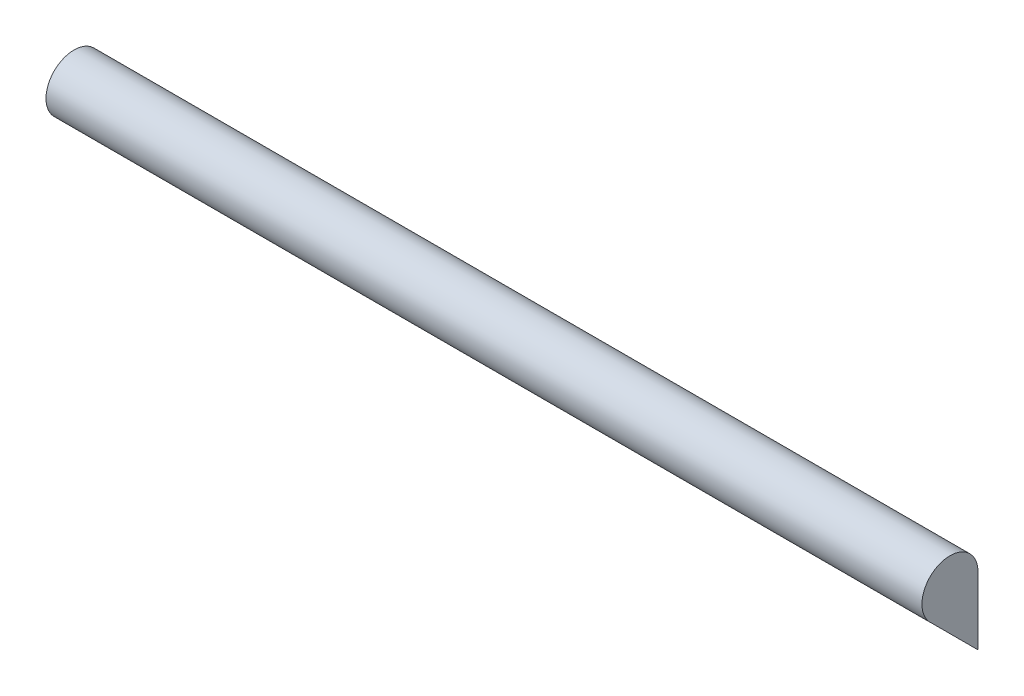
ISO-10303-21;
HEADER;
FILE_DESCRIPTION(('STEP AP214'),'2;1');
FILE_NAME('part.step','',(''),(''),'','','');
FILE_SCHEMA(('AUTOMOTIVE_DESIGN { 1 0 10303 214 1 1 1 1 }'));
ENDSEC;
DATA;
#1=APPLICATION_CONTEXT('core data for automotive mechanical design processes');
#2=APPLICATION_PROTOCOL_DEFINITION('international standard','automotive_design',2000,#1);
#3=PRODUCT_CONTEXT('',#1,'mechanical');
#4=PRODUCT('Part','Part','',(#3));
#5=PRODUCT_RELATED_PRODUCT_CATEGORY('part','',(#4));
#6=PRODUCT_DEFINITION_FORMATION('','',#4);
#7=PRODUCT_DEFINITION_CONTEXT('part definition',#1,'design');
#8=PRODUCT_DEFINITION('design','',#6,#7);
#9=PRODUCT_DEFINITION_SHAPE('','',#8);
#10=(LENGTH_UNIT() NAMED_UNIT(*) SI_UNIT(.MILLI.,.METRE.));
#11=(NAMED_UNIT(*) PLANE_ANGLE_UNIT() SI_UNIT($,.RADIAN.));
#12=(NAMED_UNIT(*) SI_UNIT($,.STERADIAN.) SOLID_ANGLE_UNIT());
#13=UNCERTAINTY_MEASURE_WITH_UNIT(LENGTH_MEASURE(1.E-05),#10,'distance_accuracy_value','');
#14=(GEOMETRIC_REPRESENTATION_CONTEXT(3) GLOBAL_UNCERTAINTY_ASSIGNED_CONTEXT((#13)) GLOBAL_UNIT_ASSIGNED_CONTEXT((#10,
#11,#12)) REPRESENTATION_CONTEXT('',''));
#15=CARTESIAN_POINT('',(0.,0.,0.));
#16=DIRECTION('',(0.,0.,1.));
#17=DIRECTION('',(1.,0.,0.));
#18=AXIS2_PLACEMENT_3D('',#15,#16,#17);
#19=CARTESIAN_POINT('',(0.,0.,0.));
#20=DIRECTION('',(0.,-0.707106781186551,0.707106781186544));
#21=DIRECTION('',(-1.,0.,0.));
#22=AXIS2_PLACEMENT_3D('',#19,#20,#21);
#23=PLANE('',#22);
#24=DIRECTION('',(-1.,0.,0.));
#25=VECTOR('',#24,1.);
#26=CARTESIAN_POINT('',(0.,3.59210244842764,3.59210244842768));
#27=LINE('',#26,#25);
#28=CARTESIAN_POINT('',(68.1829479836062,3.59210244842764,3.59210244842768));
#29=VERTEX_POINT('',#28);
#30=CARTESIAN_POINT('',(0.,3.59210244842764,3.59210244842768));
#31=VERTEX_POINT('',#30);
#32=EDGE_CURVE('E59',#29,#31,#27,.T.);
#33=ORIENTED_EDGE('',*,*,#32,.T.);
#34=DIRECTION('',(0.,0.707106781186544,0.707106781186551));
#35=VECTOR('',#34,1.);
#36=CARTESIAN_POINT('',(0.,0.,0.));
#37=LINE('',#36,#35);
#38=CARTESIAN_POINT('',(0.,0.,0.));
#39=VERTEX_POINT('',#38);
#40=EDGE_CURVE('E93',#39,#31,#37,.T.);
#41=ORIENTED_EDGE('',*,*,#40,.F.);
#42=DIRECTION('',(1.,0.,0.));
#43=VECTOR('',#42,1.);
#44=CARTESIAN_POINT('',(0.,0.,0.));
#45=LINE('',#44,#43);
#46=CARTESIAN_POINT('',(68.1829479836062,0.,0.));
#47=VERTEX_POINT('',#46);
#48=EDGE_CURVE('E88',#39,#47,#45,.T.);
#49=ORIENTED_EDGE('',*,*,#48,.T.);
#50=DIRECTION('',(0.,0.707106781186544,0.707106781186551));
#51=VECTOR('',#50,1.);
#52=CARTESIAN_POINT('',(68.1829479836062,0.,0.));
#53=LINE('',#52,#51);
#54=EDGE_CURVE('E99',#47,#29,#53,.T.);
#55=ORIENTED_EDGE('',*,*,#54,.T.);
#56=EDGE_LOOP('',(#33,#41,#49,#55));
#57=FACE_BOUND('',#56,.T.);
#58=ADVANCED_FACE('F55',(#57),#23,.T.);
#59=CARTESIAN_POINT('',(68.1829479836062,5.25285474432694,2.17580367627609));
#60=DIRECTION('',(-1.,0.,0.));
#61=DIRECTION('',(0.,0.,1.));
#62=AXIS2_PLACEMENT_3D('',#59,#60,#61);
#63=PLANE('',#62);
#64=DIRECTION('',(0.,-1.,0.));
#65=VECTOR('',#64,1.);
#66=CARTESIAN_POINT('',(68.1829479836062,5.08,0.));
#67=LINE('',#66,#65);
#68=CARTESIAN_POINT('',(68.1829479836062,5.08,0.));
#69=VERTEX_POINT('',#68);
#70=EDGE_CURVE('E109',#69,#47,#67,.T.);
#71=ORIENTED_EDGE('',*,*,#70,.F.);
#72=CARTESIAN_POINT('',(68.1829479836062,5.25285474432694,2.17580367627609));
#73=DIRECTION('',(1.,0.,0.));
#74=DIRECTION('',(0.,0.,-1.));
#75=AXIS2_PLACEMENT_3D('',#72,#73,#74);
#76=CIRCLE('',#75,2.18265902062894);
#77=EDGE_CURVE('E101',#69,#29,#76,.T.);
#78=ORIENTED_EDGE('',*,*,#77,.T.);
#79=ORIENTED_EDGE('',*,*,#54,.F.);
#80=EDGE_LOOP('',(#71,#78,#79));
#81=FACE_BOUND('',#80,.T.);
#82=ADVANCED_FACE('F121',(#81),#63,.F.);
#83=CARTESIAN_POINT('',(0.,5.08,0.));
#84=DIRECTION('',(0.,0.,-1.));
#85=DIRECTION('',(-1.,0.,0.));
#86=AXIS2_PLACEMENT_3D('',#83,#84,#85);
#87=PLANE('',#86);
#88=ORIENTED_EDGE('',*,*,#48,.F.);
#89=DIRECTION('',(0.,-1.,0.));
#90=VECTOR('',#89,1.);
#91=CARTESIAN_POINT('',(0.,5.08,0.));
#92=LINE('',#91,#90);
#93=CARTESIAN_POINT('',(0.,5.08000000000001,0.));
#94=VERTEX_POINT('',#93);
#95=EDGE_CURVE('E95',#94,#39,#92,.T.);
#96=ORIENTED_EDGE('',*,*,#95,.F.);
#97=DIRECTION('',(-1.,0.,0.));
#98=VECTOR('',#97,1.);
#99=CARTESIAN_POINT('',(0.,5.08,0.));
#100=LINE('',#99,#98);
#101=EDGE_CURVE('E65',#94,#69,#100,.F.);
#102=ORIENTED_EDGE('',*,*,#101,.T.);
#103=ORIENTED_EDGE('',*,*,#70,.T.);
#104=EDGE_LOOP('',(#88,#96,#102,#103));
#105=FACE_BOUND('',#104,.T.);
#106=ADVANCED_FACE('F120',(#105),#87,.T.);
#107=CARTESIAN_POINT('',(0.,5.25285474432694,2.17580367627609));
#108=DIRECTION('',(-1.,0.,0.));
#109=DIRECTION('',(0.,-1.,0.));
#110=AXIS2_PLACEMENT_3D('',#107,#108,#109);
#111=PLANE('',#110);
#112=ORIENTED_EDGE('',*,*,#95,.T.);
#113=ORIENTED_EDGE('',*,*,#40,.T.);
#114=CARTESIAN_POINT('',(0.,5.25285474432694,2.17580367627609));
#115=DIRECTION('',(1.,0.,0.));
#116=DIRECTION('',(0.,0.,-1.));
#117=AXIS2_PLACEMENT_3D('',#114,#115,#116);
#118=CIRCLE('',#117,2.18265902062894);
#119=EDGE_CURVE('E12',#31,#94,#118,.F.);
#120=ORIENTED_EDGE('',*,*,#119,.T.);
#121=EDGE_LOOP('',(#112,#113,#120));
#122=FACE_BOUND('',#121,.T.);
#123=ADVANCED_FACE('F94',(#122),#111,.T.);
#124=CARTESIAN_POINT('',(0.,5.25285474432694,2.17580367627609));
#125=DIRECTION('',(1.,0.,0.));
#126=DIRECTION('',(0.,0.,-1.));
#127=AXIS2_PLACEMENT_3D('',#124,#125,#126);
#128=CYLINDRICAL_SURFACE('',#127,2.18265902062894);
#129=ORIENTED_EDGE('',*,*,#119,.F.);
#130=ORIENTED_EDGE('',*,*,#32,.F.);
#131=ORIENTED_EDGE('',*,*,#77,.F.);
#132=ORIENTED_EDGE('',*,*,#101,.F.);
#133=EDGE_LOOP('',(#129,#130,#131,#132));
#134=FACE_BOUND('',#133,.T.);
#135=ADVANCED_FACE('F57',(#134),#128,.T.);
#136=CLOSED_SHELL('',(#58,#82,#106,#123,#135));
#137=MANIFOLD_SOLID_BREP('B2',#136);
#138=ADVANCED_BREP_SHAPE_REPRESENTATION('',(#18,#137),#14);
#139=SHAPE_DEFINITION_REPRESENTATION(#9,#138);
ENDSEC;
END-ISO-10303-21;
